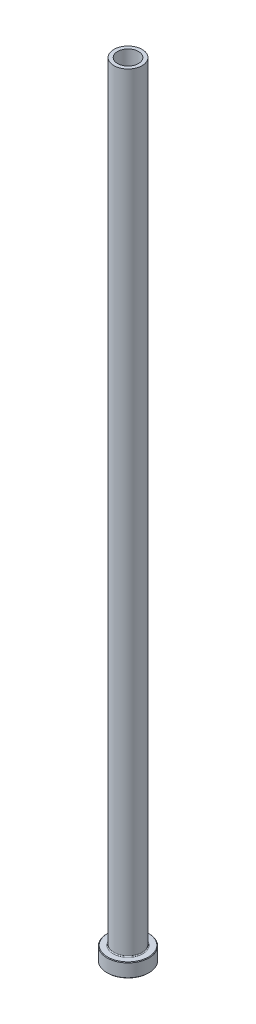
ISO-10303-21;
HEADER;
FILE_DESCRIPTION(('STEP AP214'),'2;1');
FILE_NAME('part.step','',(''),(''),'','','');
FILE_SCHEMA(('AUTOMOTIVE_DESIGN { 1 0 10303 214 1 1 1 1 }'));
ENDSEC;
DATA;
#1=APPLICATION_CONTEXT('core data for automotive mechanical design processes');
#2=APPLICATION_PROTOCOL_DEFINITION('international standard','automotive_design',2000,#1);
#3=PRODUCT_CONTEXT('',#1,'mechanical');
#4=PRODUCT('Part','Part','',(#3));
#5=PRODUCT_RELATED_PRODUCT_CATEGORY('part','',(#4));
#6=PRODUCT_DEFINITION_FORMATION('','',#4);
#7=PRODUCT_DEFINITION_CONTEXT('part definition',#1,'design');
#8=PRODUCT_DEFINITION('design','',#6,#7);
#9=PRODUCT_DEFINITION_SHAPE('','',#8);
#10=(LENGTH_UNIT() NAMED_UNIT(*) SI_UNIT(.MILLI.,.METRE.));
#11=(NAMED_UNIT(*) PLANE_ANGLE_UNIT() SI_UNIT($,.RADIAN.));
#12=(NAMED_UNIT(*) SI_UNIT($,.STERADIAN.) SOLID_ANGLE_UNIT());
#13=UNCERTAINTY_MEASURE_WITH_UNIT(LENGTH_MEASURE(1.E-05),#10,'distance_accuracy_value','');
#14=(GEOMETRIC_REPRESENTATION_CONTEXT(3) GLOBAL_UNCERTAINTY_ASSIGNED_CONTEXT((#13)) GLOBAL_UNIT_ASSIGNED_CONTEXT((#10,
#11,#12)) REPRESENTATION_CONTEXT('',''));
#15=CARTESIAN_POINT('',(0.,0.,0.));
#16=DIRECTION('',(0.,0.,1.));
#17=DIRECTION('',(1.,0.,0.));
#18=AXIS2_PLACEMENT_3D('',#15,#16,#17);
#19=CARTESIAN_POINT('',(0.,0.,0.));
#20=DIRECTION('',(0.,-1.,0.));
#21=DIRECTION('',(0.,0.,-1.));
#22=AXIS2_PLACEMENT_3D('',#19,#20,#21);
#23=PLANE('',#22);
#24=CARTESIAN_POINT('',(0.,0.,0.));
#25=DIRECTION('',(0.,-1.,0.));
#26=DIRECTION('',(0.,0.,-1.));
#27=AXIS2_PLACEMENT_3D('',#24,#25,#26);
#28=CIRCLE('',#27,9.27099999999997);
#29=CARTESIAN_POINT('',(0.,0.,-9.27099999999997));
#30=VERTEX_POINT('',#29);
#31=EDGE_CURVE('E44',#30,#30,#28,.T.);
#32=ORIENTED_EDGE('',*,*,#31,.T.);
#33=EDGE_LOOP('',(#32));
#34=FACE_BOUND('',#33,.T.);
#35=CARTESIAN_POINT('',(0.,0.,0.));
#36=DIRECTION('',(0.,-1.,0.));
#37=DIRECTION('',(0.,0.,-1.));
#38=AXIS2_PLACEMENT_3D('',#35,#36,#37);
#39=CIRCLE('',#38,5.34987500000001);
#40=CARTESIAN_POINT('',(0.,0.,-5.34987500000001));
#41=VERTEX_POINT('',#40);
#42=EDGE_CURVE('E58',#41,#41,#39,.T.);
#43=ORIENTED_EDGE('',*,*,#42,.F.);
#44=EDGE_LOOP('',(#43));
#45=FACE_BOUND('',#44,.T.);
#46=ADVANCED_FACE('F29',(#34,#45),#23,.T.);
#47=CARTESIAN_POINT('',(0.,0.,0.));
#48=DIRECTION('',(0.,-1.,0.));
#49=DIRECTION('',(0.,0.,-1.));
#50=AXIS2_PLACEMENT_3D('',#47,#48,#49);
#51=CYLINDRICAL_SURFACE('',#50,9.525);
#52=CARTESIAN_POINT('',(0.,0.254000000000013,0.));
#53=DIRECTION('',(0.,-1.,0.));
#54=DIRECTION('',(0.,0.,-1.));
#55=AXIS2_PLACEMENT_3D('',#52,#53,#54);
#56=CIRCLE('',#55,9.525);
#57=CARTESIAN_POINT('',(0.,0.254000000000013,-9.525));
#58=VERTEX_POINT('',#57);
#59=EDGE_CURVE('E36',#58,#58,#56,.F.);
#60=ORIENTED_EDGE('',*,*,#59,.T.);
#61=EDGE_LOOP('',(#60));
#62=FACE_BOUND('',#61,.T.);
#63=CARTESIAN_POINT('',(0.,6.09599999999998,0.));
#64=DIRECTION('',(0.,1.,0.));
#65=DIRECTION('',(0.,0.,1.));
#66=AXIS2_PLACEMENT_3D('',#63,#64,#65);
#67=CIRCLE('',#66,9.525);
#68=CARTESIAN_POINT('',(0.,6.09599999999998,9.525));
#69=VERTEX_POINT('',#68);
#70=EDGE_CURVE('E40',#69,#69,#67,.F.);
#71=ORIENTED_EDGE('',*,*,#70,.T.);
#72=EDGE_LOOP('',(#71));
#73=FACE_BOUND('',#72,.T.);
#74=ADVANCED_FACE('F103',(#62,#73),#51,.T.);
#75=CARTESIAN_POINT('',(9.525,6.35,0.));
#76=DIRECTION('',(0.,1.,0.));
#77=DIRECTION('',(0.,0.,1.));
#78=AXIS2_PLACEMENT_3D('',#75,#76,#77);
#79=PLANE('',#78);
#80=CARTESIAN_POINT('',(0.,6.35,0.));
#81=DIRECTION('',(0.,1.,0.));
#82=DIRECTION('',(0.,0.,1.));
#83=AXIS2_PLACEMENT_3D('',#80,#81,#82);
#84=CIRCLE('',#83,9.271);
#85=CARTESIAN_POINT('',(0.,6.35,9.271));
#86=VERTEX_POINT('',#85);
#87=EDGE_CURVE('E10',#86,#86,#84,.T.);
#88=ORIENTED_EDGE('',*,*,#87,.T.);
#89=EDGE_LOOP('',(#88));
#90=FACE_BOUND('',#89,.T.);
#91=CARTESIAN_POINT('',(0.,6.35,0.));
#92=DIRECTION('',(0.,-1.,0.));
#93=DIRECTION('',(0.,0.,-1.));
#94=AXIS2_PLACEMENT_3D('',#91,#92,#93);
#95=CIRCLE('',#94,6.804025);
#96=CARTESIAN_POINT('',(0.,6.35,-6.804025));
#97=VERTEX_POINT('',#96);
#98=EDGE_CURVE('E49',#97,#97,#95,.T.);
#99=ORIENTED_EDGE('',*,*,#98,.T.);
#100=EDGE_LOOP('',(#99));
#101=FACE_BOUND('',#100,.T.);
#102=ADVANCED_FACE('F109',(#90,#101),#79,.T.);
#103=CARTESIAN_POINT('',(0.,6.746875,0.));
#104=DIRECTION('',(0.,-1.,0.));
#105=DIRECTION('',(0.,0.,-1.));
#106=AXIS2_PLACEMENT_3D('',#103,#104,#105);
#107=TOROIDAL_SURFACE('',#106,6.804025,0.396874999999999);
#108=CARTESIAN_POINT('',(0.,6.746875,0.));
#109=DIRECTION('',(0.,-1.,0.));
#110=DIRECTION('',(0.,0.,-1.));
#111=AXIS2_PLACEMENT_3D('',#108,#109,#110);
#112=CIRCLE('',#111,6.40715);
#113=CARTESIAN_POINT('',(0.,6.746875,-6.40715));
#114=VERTEX_POINT('',#113);
#115=EDGE_CURVE('E52',#114,#114,#112,.T.);
#116=ORIENTED_EDGE('',*,*,#115,.T.);
#117=EDGE_LOOP('',(#116));
#118=FACE_BOUND('',#117,.T.);
#119=ORIENTED_EDGE('',*,*,#98,.F.);
#120=EDGE_LOOP('',(#119));
#121=FACE_BOUND('',#120,.T.);
#122=ADVANCED_FACE('F139',(#118,#121),#107,.F.);
#123=CARTESIAN_POINT('',(0.,0.,0.));
#124=DIRECTION('',(0.,-1.,0.));
#125=DIRECTION('',(0.,0.,-1.));
#126=AXIS2_PLACEMENT_3D('',#123,#124,#125);
#127=CYLINDRICAL_SURFACE('',#126,6.40715);
#128=CARTESIAN_POINT('',(0.,355.6,0.));
#129=DIRECTION('',(0.,-1.,0.));
#130=DIRECTION('',(0.,0.,-1.));
#131=AXIS2_PLACEMENT_3D('',#128,#129,#130);
#132=CIRCLE('',#131,6.40715);
#133=CARTESIAN_POINT('',(0.,355.6,-6.40715));
#134=VERTEX_POINT('',#133);
#135=EDGE_CURVE('E55',#134,#134,#132,.T.);
#136=ORIENTED_EDGE('',*,*,#135,.T.);
#137=EDGE_LOOP('',(#136));
#138=FACE_BOUND('',#137,.T.);
#139=ORIENTED_EDGE('',*,*,#115,.F.);
#140=EDGE_LOOP('',(#139));
#141=FACE_BOUND('',#140,.T.);
#142=ADVANCED_FACE('F182',(#138,#141),#127,.T.);
#143=CARTESIAN_POINT('',(6.40715,355.6,0.));
#144=DIRECTION('',(0.,1.,0.));
#145=DIRECTION('',(0.,0.,1.));
#146=AXIS2_PLACEMENT_3D('',#143,#144,#145);
#147=PLANE('',#146);
#148=CARTESIAN_POINT('',(0.,355.6,0.));
#149=DIRECTION('',(0.,-1.,0.));
#150=DIRECTION('',(0.,0.,-1.));
#151=AXIS2_PLACEMENT_3D('',#148,#149,#150);
#152=CIRCLE('',#151,4.7625);
#153=CARTESIAN_POINT('',(0.,355.6,-4.7625));
#154=VERTEX_POINT('',#153);
#155=EDGE_CURVE('E70',#154,#154,#152,.T.);
#156=ORIENTED_EDGE('',*,*,#155,.T.);
#157=EDGE_LOOP('',(#156));
#158=FACE_BOUND('',#157,.T.);
#159=ORIENTED_EDGE('',*,*,#135,.F.);
#160=EDGE_LOOP('',(#159));
#161=FACE_BOUND('',#160,.T.);
#162=ADVANCED_FACE('F74',(#158,#161),#147,.T.);
#163=CARTESIAN_POINT('',(0.,0.,0.));
#164=DIRECTION('',(0.,-1.,0.));
#165=DIRECTION('',(0.,0.,-1.));
#166=AXIS2_PLACEMENT_3D('',#163,#164,#165);
#167=CONICAL_SURFACE('',#166,5.34987500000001,0.785398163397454);
#168=CARTESIAN_POINT('',(0.,0.396875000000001,0.));
#169=DIRECTION('',(0.,-1.,0.));
#170=DIRECTION('',(0.,0.,-1.));
#171=AXIS2_PLACEMENT_3D('',#168,#169,#170);
#172=CIRCLE('',#171,4.953);
#173=CARTESIAN_POINT('',(0.,0.396875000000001,-4.953));
#174=VERTEX_POINT('',#173);
#175=EDGE_CURVE('E61',#174,#174,#172,.T.);
#176=ORIENTED_EDGE('',*,*,#175,.F.);
#177=EDGE_LOOP('',(#176));
#178=FACE_BOUND('',#177,.T.);
#179=ORIENTED_EDGE('',*,*,#42,.T.);
#180=EDGE_LOOP('',(#179));
#181=FACE_BOUND('',#180,.T.);
#182=ADVANCED_FACE('F93',(#178,#181),#167,.F.);
#183=CARTESIAN_POINT('',(0.,0.,0.));
#184=DIRECTION('',(0.,-1.,0.));
#185=DIRECTION('',(0.,0.,-1.));
#186=AXIS2_PLACEMENT_3D('',#183,#184,#185);
#187=CYLINDRICAL_SURFACE('',#186,4.953);
#188=CARTESIAN_POINT('',(0.,281.1145,0.));
#189=DIRECTION('',(0.,-1.,0.));
#190=DIRECTION('',(0.,0.,-1.));
#191=AXIS2_PLACEMENT_3D('',#188,#189,#190);
#192=CIRCLE('',#191,4.953);
#193=CARTESIAN_POINT('',(0.,281.1145,-4.953));
#194=VERTEX_POINT('',#193);
#195=EDGE_CURVE('E64',#194,#194,#192,.T.);
#196=ORIENTED_EDGE('',*,*,#195,.F.);
#197=EDGE_LOOP('',(#196));
#198=FACE_BOUND('',#197,.T.);
#199=ORIENTED_EDGE('',*,*,#175,.T.);
#200=EDGE_LOOP('',(#199));
#201=FACE_BOUND('',#200,.T.);
#202=ADVANCED_FACE('F87',(#198,#201),#187,.F.);
#203=CARTESIAN_POINT('',(0.,281.1145,0.));
#204=DIRECTION('',(0.,-1.,0.));
#205=DIRECTION('',(0.,0.,-1.));
#206=AXIS2_PLACEMENT_3D('',#203,#204,#205);
#207=CONICAL_SURFACE('',#206,4.953,0.0133325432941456);
#208=CARTESIAN_POINT('',(0.,295.402,0.));
#209=DIRECTION('',(0.,-1.,0.));
#210=DIRECTION('',(0.,0.,-1.));
#211=AXIS2_PLACEMENT_3D('',#208,#209,#210);
#212=CIRCLE('',#211,4.7625);
#213=CARTESIAN_POINT('',(0.,295.402,-4.7625));
#214=VERTEX_POINT('',#213);
#215=EDGE_CURVE('E67',#214,#214,#212,.T.);
#216=ORIENTED_EDGE('',*,*,#215,.F.);
#217=EDGE_LOOP('',(#216));
#218=FACE_BOUND('',#217,.T.);
#219=ORIENTED_EDGE('',*,*,#195,.T.);
#220=EDGE_LOOP('',(#219));
#221=FACE_BOUND('',#220,.T.);
#222=ADVANCED_FACE('F81',(#218,#221),#207,.F.);
#223=CARTESIAN_POINT('',(0.,0.,0.));
#224=DIRECTION('',(0.,-1.,0.));
#225=DIRECTION('',(0.,0.,-1.));
#226=AXIS2_PLACEMENT_3D('',#223,#224,#225);
#227=CYLINDRICAL_SURFACE('',#226,4.7625);
#228=ORIENTED_EDGE('',*,*,#155,.F.);
#229=EDGE_LOOP('',(#228));
#230=FACE_BOUND('',#229,.T.);
#231=ORIENTED_EDGE('',*,*,#215,.T.);
#232=EDGE_LOOP('',(#231));
#233=FACE_BOUND('',#232,.T.);
#234=ADVANCED_FACE('F77',(#230,#233),#227,.F.);
#235=CARTESIAN_POINT('',(0.,0.,0.));
#236=DIRECTION('',(0.,1.,0.));
#237=DIRECTION('',(0.,0.,1.));
#238=AXIS2_PLACEMENT_3D('',#235,#236,#237);
#239=CONICAL_SURFACE('',#238,9.27099999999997,0.785398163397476);
#240=ORIENTED_EDGE('',*,*,#59,.F.);
#241=EDGE_LOOP('',(#240));
#242=FACE_BOUND('',#241,.T.);
#243=ORIENTED_EDGE('',*,*,#31,.F.);
#244=EDGE_LOOP('',(#243));
#245=FACE_BOUND('',#244,.T.);
#246=ADVANCED_FACE('F80',(#242,#245),#239,.T.);
#247=CARTESIAN_POINT('',(0.,6.09599999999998,0.));
#248=DIRECTION('',(0.,-1.,0.));
#249=DIRECTION('',(0.,0.,-1.));
#250=AXIS2_PLACEMENT_3D('',#247,#248,#249);
#251=CONICAL_SURFACE('',#250,9.525,0.785398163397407);
#252=ORIENTED_EDGE('',*,*,#87,.F.);
#253=EDGE_LOOP('',(#252));
#254=FACE_BOUND('',#253,.T.);
#255=ORIENTED_EDGE('',*,*,#70,.F.);
#256=EDGE_LOOP('',(#255));
#257=FACE_BOUND('',#256,.T.);
#258=ADVANCED_FACE('F31',(#254,#257),#251,.T.);
#259=CLOSED_SHELL('',(#46,#74,#102,#122,#142,#162,#182,#202,#222,#234,#246,#258));
#260=MANIFOLD_SOLID_BREP('B2',#259);
#261=ADVANCED_BREP_SHAPE_REPRESENTATION('',(#18,#260),#14);
#262=SHAPE_DEFINITION_REPRESENTATION(#9,#261);
ENDSEC;
END-ISO-10303-21;
